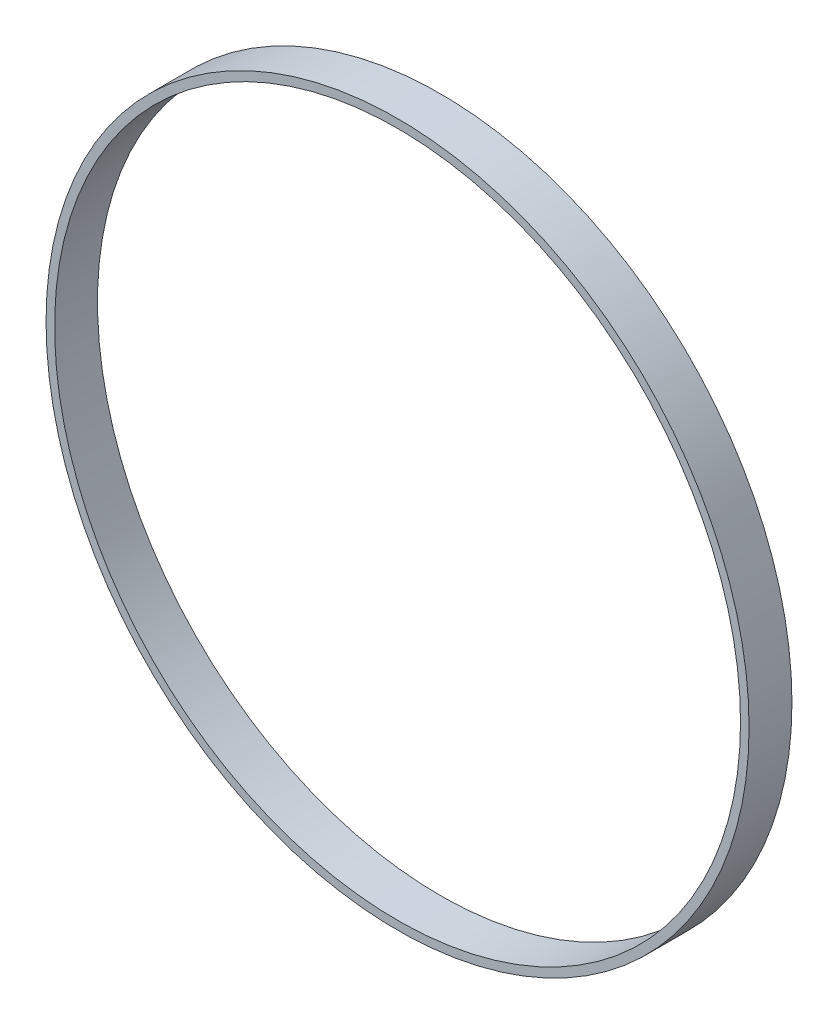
from build123d import *

# Parameters (mm, degrees)
ESQUISSE1_R      = 41
ESQUISSE1_R_2    = 40
EXTRUSION1_DEPTH = 5


with BuildPart() as part:
    # Esquisse1 → Extrusion1 (new body)
    with BuildSketch(Plane.XY):
        Circle(ESQUISSE1_R)
        Circle(ESQUISSE1_R_2, mode=Mode.SUBTRACT)
    extrude(amount=EXTRUSION1_DEPTH)


solid = part.part
